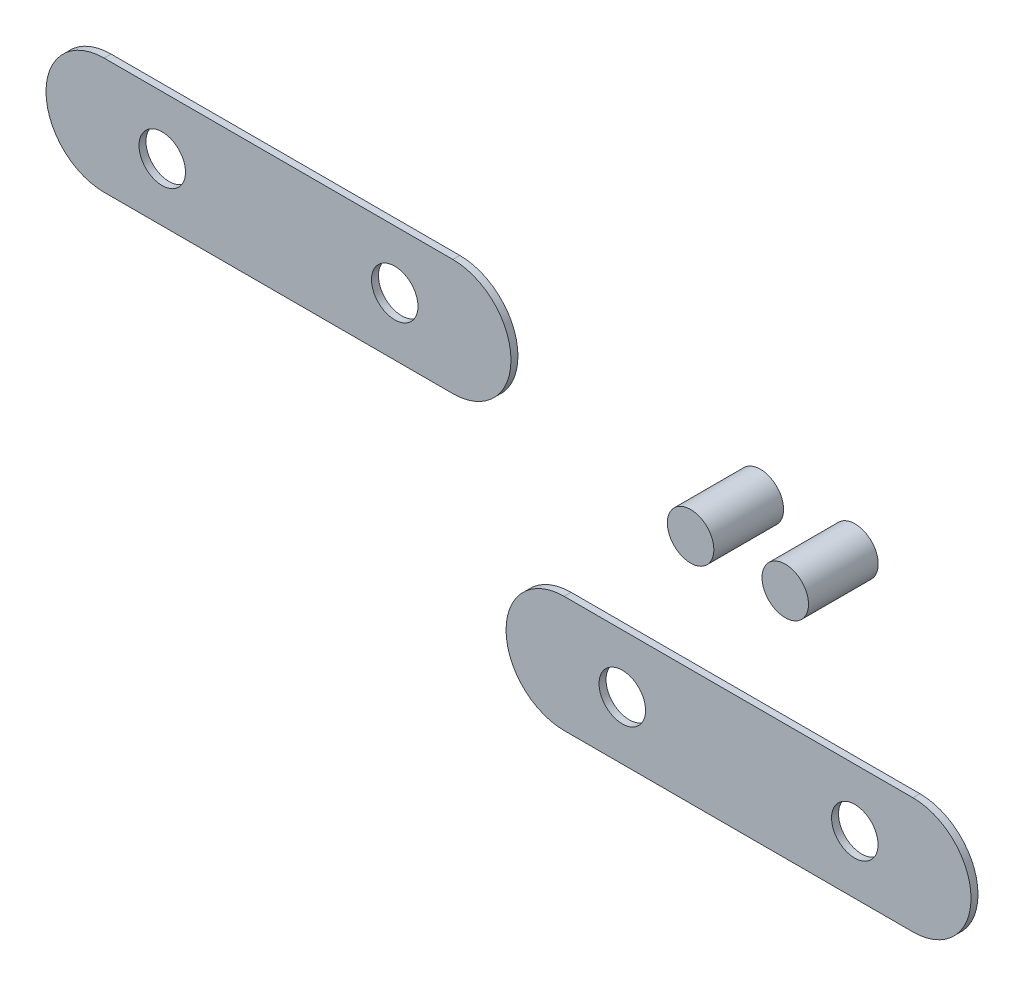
ISO-10303-21;
HEADER;
FILE_DESCRIPTION(('STEP AP214'),'2;1');
FILE_NAME('part.step','',(''),(''),'','','');
FILE_SCHEMA(('AUTOMOTIVE_DESIGN { 1 0 10303 214 1 1 1 1 }'));
ENDSEC;
DATA;
#1=APPLICATION_CONTEXT('core data for automotive mechanical design processes');
#2=APPLICATION_PROTOCOL_DEFINITION('international standard','automotive_design',2000,#1);
#3=PRODUCT_CONTEXT('',#1,'mechanical');
#4=PRODUCT('Part','Part','',(#3));
#5=PRODUCT_RELATED_PRODUCT_CATEGORY('part','',(#4));
#6=PRODUCT_DEFINITION_FORMATION('','',#4);
#7=PRODUCT_DEFINITION_CONTEXT('part definition',#1,'design');
#8=PRODUCT_DEFINITION('design','',#6,#7);
#9=PRODUCT_DEFINITION_SHAPE('','',#8);
#10=(LENGTH_UNIT() NAMED_UNIT(*) SI_UNIT(.MILLI.,.METRE.));
#11=(NAMED_UNIT(*) PLANE_ANGLE_UNIT() SI_UNIT($,.RADIAN.));
#12=(NAMED_UNIT(*) SI_UNIT($,.STERADIAN.) SOLID_ANGLE_UNIT());
#13=UNCERTAINTY_MEASURE_WITH_UNIT(LENGTH_MEASURE(1.E-05),#10,'distance_accuracy_value','');
#14=(GEOMETRIC_REPRESENTATION_CONTEXT(3) GLOBAL_UNCERTAINTY_ASSIGNED_CONTEXT((#13)) GLOBAL_UNIT_ASSIGNED_CONTEXT((#10,
#11,#12)) REPRESENTATION_CONTEXT('',''));
#15=CARTESIAN_POINT('',(0.,0.,0.));
#16=DIRECTION('',(0.,0.,1.));
#17=DIRECTION('',(1.,0.,0.));
#18=AXIS2_PLACEMENT_3D('',#15,#16,#17);
#19=CARTESIAN_POINT('',(-17.3942241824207,0.,0.3));
#20=DIRECTION('',(0.,1.,0.));
#21=DIRECTION('',(0.,0.,1.));
#22=AXIS2_PLACEMENT_3D('',#19,#20,#21);
#23=PLANE('',#22);
#24=DIRECTION('',(1.,0.,0.));
#25=VECTOR('',#24,1.);
#26=CARTESIAN_POINT('',(-17.3942241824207,0.,0.));
#27=LINE('',#26,#25);
#28=CARTESIAN_POINT('',(-15.,0.,0.));
#29=VERTEX_POINT('',#28);
#30=CARTESIAN_POINT('',(0.,0.,0.));
#31=VERTEX_POINT('',#30);
#32=EDGE_CURVE('E122',#29,#31,#27,.T.);
#33=ORIENTED_EDGE('',*,*,#32,.F.);
#34=DIRECTION('',(0.,0.,-1.));
#35=VECTOR('',#34,1.);
#36=CARTESIAN_POINT('',(-15.,0.,0.3));
#37=LINE('',#36,#35);
#38=CARTESIAN_POINT('',(-15.,0.,0.3));
#39=VERTEX_POINT('',#38);
#40=EDGE_CURVE('E12',#39,#29,#37,.T.);
#41=ORIENTED_EDGE('',*,*,#40,.F.);
#42=DIRECTION('',(1.,0.,0.));
#43=VECTOR('',#42,1.);
#44=CARTESIAN_POINT('',(-17.3942241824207,0.,0.3));
#45=LINE('',#44,#43);
#46=CARTESIAN_POINT('',(0.,0.,0.3));
#47=VERTEX_POINT('',#46);
#48=EDGE_CURVE('E104',#39,#47,#45,.T.);
#49=ORIENTED_EDGE('',*,*,#48,.T.);
#50=DIRECTION('',(0.,0.,-1.));
#51=VECTOR('',#50,1.);
#52=CARTESIAN_POINT('',(0.,0.,0.3));
#53=LINE('',#52,#51);
#54=EDGE_CURVE('E85',#47,#31,#53,.T.);
#55=ORIENTED_EDGE('',*,*,#54,.T.);
#56=EDGE_LOOP('',(#33,#41,#49,#55));
#57=FACE_BOUND('',#56,.T.);
#58=ADVANCED_FACE('F46',(#57),#23,.T.);
#59=CARTESIAN_POINT('',(-15.,-2.5,0.3));
#60=DIRECTION('',(0.,0.,-1.));
#61=DIRECTION('',(-1.,0.,0.));
#62=AXIS2_PLACEMENT_3D('',#59,#60,#61);
#63=CYLINDRICAL_SURFACE('',#62,2.5);
#64=CARTESIAN_POINT('',(-15.,-2.5,0.));
#65=DIRECTION('',(0.,0.,1.));
#66=DIRECTION('',(1.,0.,0.));
#67=AXIS2_PLACEMENT_3D('',#64,#65,#66);
#68=CIRCLE('',#67,2.5);
#69=CARTESIAN_POINT('',(-15.,-5.,0.));
#70=VERTEX_POINT('',#69);
#71=EDGE_CURVE('E109',#29,#70,#68,.T.);
#72=ORIENTED_EDGE('',*,*,#71,.T.);
#73=DIRECTION('',(0.,0.,-1.));
#74=VECTOR('',#73,1.);
#75=CARTESIAN_POINT('',(-15.,-5.,0.3));
#76=LINE('',#75,#74);
#77=CARTESIAN_POINT('',(-15.,-5.,0.3));
#78=VERTEX_POINT('',#77);
#79=EDGE_CURVE('E55',#78,#70,#76,.T.);
#80=ORIENTED_EDGE('',*,*,#79,.F.);
#81=CARTESIAN_POINT('',(-15.,-2.5,0.3));
#82=DIRECTION('',(0.,0.,1.));
#83=DIRECTION('',(1.,0.,0.));
#84=AXIS2_PLACEMENT_3D('',#81,#82,#83);
#85=CIRCLE('',#84,2.5);
#86=EDGE_CURVE('E100',#39,#78,#85,.T.);
#87=ORIENTED_EDGE('',*,*,#86,.F.);
#88=ORIENTED_EDGE('',*,*,#40,.T.);
#89=EDGE_LOOP('',(#72,#80,#87,#88));
#90=FACE_BOUND('',#89,.T.);
#91=ADVANCED_FACE('F107',(#90),#63,.T.);
#92=CARTESIAN_POINT('',(-17.3942241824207,-5.,0.3));
#93=DIRECTION('',(0.,1.,0.));
#94=DIRECTION('',(0.,0.,1.));
#95=AXIS2_PLACEMENT_3D('',#92,#93,#94);
#96=PLANE('',#95);
#97=DIRECTION('',(1.,0.,0.));
#98=VECTOR('',#97,1.);
#99=CARTESIAN_POINT('',(-17.3942241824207,-5.,0.));
#100=LINE('',#99,#98);
#101=CARTESIAN_POINT('',(0.,-5.,0.));
#102=VERTEX_POINT('',#101);
#103=EDGE_CURVE('E119',#70,#102,#100,.T.);
#104=ORIENTED_EDGE('',*,*,#103,.T.);
#105=DIRECTION('',(0.,0.,-1.));
#106=VECTOR('',#105,1.);
#107=CARTESIAN_POINT('',(0.,-5.,0.3));
#108=LINE('',#107,#106);
#109=CARTESIAN_POINT('',(0.,-5.,0.3));
#110=VERTEX_POINT('',#109);
#111=EDGE_CURVE('E99',#110,#102,#108,.T.);
#112=ORIENTED_EDGE('',*,*,#111,.F.);
#113=DIRECTION('',(1.,0.,0.));
#114=VECTOR('',#113,1.);
#115=CARTESIAN_POINT('',(-17.3942241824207,-5.,0.3));
#116=LINE('',#115,#114);
#117=EDGE_CURVE('E93',#78,#110,#116,.T.);
#118=ORIENTED_EDGE('',*,*,#117,.F.);
#119=ORIENTED_EDGE('',*,*,#79,.T.);
#120=EDGE_LOOP('',(#104,#112,#118,#119));
#121=FACE_BOUND('',#120,.T.);
#122=ADVANCED_FACE('F96',(#121),#96,.F.);
#123=CARTESIAN_POINT('',(0.,-2.5,0.3));
#124=DIRECTION('',(0.,0.,-1.));
#125=DIRECTION('',(-1.,0.,0.));
#126=AXIS2_PLACEMENT_3D('',#123,#124,#125);
#127=CYLINDRICAL_SURFACE('',#126,2.5);
#128=CARTESIAN_POINT('',(0.,-2.5,0.));
#129=DIRECTION('',(0.,0.,1.));
#130=DIRECTION('',(1.,0.,0.));
#131=AXIS2_PLACEMENT_3D('',#128,#129,#130);
#132=CIRCLE('',#131,2.5);
#133=EDGE_CURVE('E78',#102,#31,#132,.T.);
#134=ORIENTED_EDGE('',*,*,#133,.T.);
#135=ORIENTED_EDGE('',*,*,#54,.F.);
#136=CARTESIAN_POINT('',(0.,-2.5,0.3));
#137=DIRECTION('',(0.,0.,1.));
#138=DIRECTION('',(1.,0.,0.));
#139=AXIS2_PLACEMENT_3D('',#136,#137,#138);
#140=CIRCLE('',#139,2.5);
#141=EDGE_CURVE('E63',#110,#47,#140,.T.);
#142=ORIENTED_EDGE('',*,*,#141,.F.);
#143=ORIENTED_EDGE('',*,*,#111,.T.);
#144=EDGE_LOOP('',(#134,#135,#142,#143));
#145=FACE_BOUND('',#144,.T.);
#146=ADVANCED_FACE('F156',(#145),#127,.T.);
#147=CARTESIAN_POINT('',(-2.5,-2.5,0.3));
#148=DIRECTION('',(0.,0.,-1.));
#149=DIRECTION('',(-1.,0.,0.));
#150=AXIS2_PLACEMENT_3D('',#147,#148,#149);
#151=CYLINDRICAL_SURFACE('',#150,1.);
#152=CARTESIAN_POINT('',(-2.5,-2.5,0.3));
#153=DIRECTION('',(0.,0.,1.));
#154=DIRECTION('',(1.,0.,0.));
#155=AXIS2_PLACEMENT_3D('',#152,#153,#154);
#156=CIRCLE('',#155,1.);
#157=CARTESIAN_POINT('',(-1.5,-2.5,0.3));
#158=VERTEX_POINT('',#157);
#159=EDGE_CURVE('E117',#158,#158,#156,.T.);
#160=ORIENTED_EDGE('',*,*,#159,.T.);
#161=EDGE_LOOP('',(#160));
#162=FACE_BOUND('',#161,.T.);
#163=CARTESIAN_POINT('',(-2.5,-2.5,0.));
#164=DIRECTION('',(0.,0.,1.));
#165=DIRECTION('',(1.,0.,0.));
#166=AXIS2_PLACEMENT_3D('',#163,#164,#165);
#167=CIRCLE('',#166,1.);
#168=CARTESIAN_POINT('',(-1.5,-2.5,0.));
#169=VERTEX_POINT('',#168);
#170=EDGE_CURVE('E124',#169,#169,#167,.T.);
#171=ORIENTED_EDGE('',*,*,#170,.F.);
#172=EDGE_LOOP('',(#171));
#173=FACE_BOUND('',#172,.T.);
#174=ADVANCED_FACE('F48',(#162,#173),#151,.F.);
#175=CARTESIAN_POINT('',(-12.5,-2.5,0.3));
#176=DIRECTION('',(0.,0.,-1.));
#177=DIRECTION('',(-1.,0.,0.));
#178=AXIS2_PLACEMENT_3D('',#175,#176,#177);
#179=CYLINDRICAL_SURFACE('',#178,1.);
#180=CARTESIAN_POINT('',(-12.5,-2.5,0.3));
#181=DIRECTION('',(0.,0.,1.));
#182=DIRECTION('',(1.,0.,0.));
#183=AXIS2_PLACEMENT_3D('',#180,#181,#182);
#184=CIRCLE('',#183,1.);
#185=CARTESIAN_POINT('',(-11.5,-2.5,0.3));
#186=VERTEX_POINT('',#185);
#187=EDGE_CURVE('E113',#186,#186,#184,.T.);
#188=ORIENTED_EDGE('',*,*,#187,.T.);
#189=EDGE_LOOP('',(#188));
#190=FACE_BOUND('',#189,.T.);
#191=CARTESIAN_POINT('',(-12.5,-2.5,0.));
#192=DIRECTION('',(0.,0.,1.));
#193=DIRECTION('',(1.,0.,0.));
#194=AXIS2_PLACEMENT_3D('',#191,#192,#193);
#195=CIRCLE('',#194,1.);
#196=CARTESIAN_POINT('',(-11.5,-2.5,0.));
#197=VERTEX_POINT('',#196);
#198=EDGE_CURVE('E114',#197,#197,#195,.T.);
#199=ORIENTED_EDGE('',*,*,#198,.F.);
#200=EDGE_LOOP('',(#199));
#201=FACE_BOUND('',#200,.T.);
#202=ADVANCED_FACE('F138',(#190,#201),#179,.F.);
#203=CARTESIAN_POINT('',(-17.3942241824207,-30.6805718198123,0.3));
#204=DIRECTION('',(0.,0.,1.));
#205=DIRECTION('',(1.,0.,0.));
#206=AXIS2_PLACEMENT_3D('',#203,#204,#205);
#207=PLANE('',#206);
#208=ORIENTED_EDGE('',*,*,#159,.F.);
#209=EDGE_LOOP('',(#208));
#210=FACE_BOUND('',#209,.T.);
#211=ORIENTED_EDGE('',*,*,#48,.F.);
#212=ORIENTED_EDGE('',*,*,#86,.T.);
#213=ORIENTED_EDGE('',*,*,#117,.T.);
#214=ORIENTED_EDGE('',*,*,#141,.T.);
#215=EDGE_LOOP('',(#211,#212,#213,#214));
#216=FACE_BOUND('',#215,.T.);
#217=ORIENTED_EDGE('',*,*,#187,.F.);
#218=EDGE_LOOP('',(#217));
#219=FACE_BOUND('',#218,.T.);
#220=ADVANCED_FACE('F102',(#210,#216,#219),#207,.T.);
#221=CARTESIAN_POINT('',(-17.3942241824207,-30.6805718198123,0.));
#222=DIRECTION('',(0.,0.,1.));
#223=DIRECTION('',(1.,0.,0.));
#224=AXIS2_PLACEMENT_3D('',#221,#222,#223);
#225=PLANE('',#224);
#226=ORIENTED_EDGE('',*,*,#170,.T.);
#227=EDGE_LOOP('',(#226));
#228=FACE_BOUND('',#227,.T.);
#229=ORIENTED_EDGE('',*,*,#32,.T.);
#230=ORIENTED_EDGE('',*,*,#133,.F.);
#231=ORIENTED_EDGE('',*,*,#103,.F.);
#232=ORIENTED_EDGE('',*,*,#71,.F.);
#233=EDGE_LOOP('',(#229,#230,#231,#232));
#234=FACE_BOUND('',#233,.T.);
#235=ORIENTED_EDGE('',*,*,#198,.T.);
#236=EDGE_LOOP('',(#235));
#237=FACE_BOUND('',#236,.T.);
#238=ADVANCED_FACE('F137',(#228,#234,#237),#225,.F.);
#239=CLOSED_SHELL('',(#58,#91,#122,#146,#174,#202,#220,#238));
#240=MANIFOLD_SOLID_BREP('B2',#239);
#241=CARTESIAN_POINT('',(-17.3942241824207,10.1569098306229,0.3));
#242=DIRECTION('',(0.,1.,0.));
#243=DIRECTION('',(0.,0.,1.));
#244=AXIS2_PLACEMENT_3D('',#241,#242,#243);
#245=PLANE('',#244);
#246=DIRECTION('',(1.,0.,0.));
#247=VECTOR('',#246,1.);
#248=CARTESIAN_POINT('',(-17.3942241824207,10.1569098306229,0.));
#249=LINE('',#248,#247);
#250=CARTESIAN_POINT('',(-34.7884483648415,10.1569098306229,0.));
#251=VERTEX_POINT('',#250);
#252=CARTESIAN_POINT('',(-19.7884483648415,10.1569098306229,0.));
#253=VERTEX_POINT('',#252);
#254=EDGE_CURVE('E320',#251,#253,#249,.T.);
#255=ORIENTED_EDGE('',*,*,#254,.F.);
#256=DIRECTION('',(0.,0.,-1.));
#257=VECTOR('',#256,1.);
#258=CARTESIAN_POINT('',(-34.7884483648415,10.1569098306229,0.3));
#259=LINE('',#258,#257);
#260=CARTESIAN_POINT('',(-34.7884483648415,10.1569098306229,0.3));
#261=VERTEX_POINT('',#260);
#262=EDGE_CURVE('E44',#261,#251,#259,.T.);
#263=ORIENTED_EDGE('',*,*,#262,.F.);
#264=DIRECTION('',(1.,0.,0.));
#265=VECTOR('',#264,1.);
#266=CARTESIAN_POINT('',(-17.3942241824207,10.1569098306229,0.3));
#267=LINE('',#266,#265);
#268=CARTESIAN_POINT('',(-19.7884483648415,10.1569098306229,0.3));
#269=VERTEX_POINT('',#268);
#270=EDGE_CURVE('E302',#261,#269,#267,.T.);
#271=ORIENTED_EDGE('',*,*,#270,.T.);
#272=DIRECTION('',(0.,0.,-1.));
#273=VECTOR('',#272,1.);
#274=CARTESIAN_POINT('',(-19.7884483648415,10.1569098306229,0.3));
#275=LINE('',#274,#273);
#276=EDGE_CURVE('E283',#269,#253,#275,.T.);
#277=ORIENTED_EDGE('',*,*,#276,.T.);
#278=EDGE_LOOP('',(#255,#263,#271,#277));
#279=FACE_BOUND('',#278,.T.);
#280=ADVANCED_FACE('F244',(#279),#245,.T.);
#281=CARTESIAN_POINT('',(-34.7884483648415,7.65690983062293,0.3));
#282=DIRECTION('',(0.,0.,-1.));
#283=DIRECTION('',(-1.,0.,0.));
#284=AXIS2_PLACEMENT_3D('',#281,#282,#283);
#285=CYLINDRICAL_SURFACE('',#284,2.5);
#286=CARTESIAN_POINT('',(-34.7884483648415,7.65690983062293,0.));
#287=DIRECTION('',(0.,0.,1.));
#288=DIRECTION('',(1.,0.,0.));
#289=AXIS2_PLACEMENT_3D('',#286,#287,#288);
#290=CIRCLE('',#289,2.5);
#291=CARTESIAN_POINT('',(-34.7884483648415,5.15690983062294,0.));
#292=VERTEX_POINT('',#291);
#293=EDGE_CURVE('E307',#251,#292,#290,.T.);
#294=ORIENTED_EDGE('',*,*,#293,.T.);
#295=DIRECTION('',(0.,0.,-1.));
#296=VECTOR('',#295,1.);
#297=CARTESIAN_POINT('',(-34.7884483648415,5.15690983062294,0.3));
#298=LINE('',#297,#296);
#299=CARTESIAN_POINT('',(-34.7884483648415,5.15690983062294,0.3));
#300=VERTEX_POINT('',#299);
#301=EDGE_CURVE('E253',#300,#292,#298,.T.);
#302=ORIENTED_EDGE('',*,*,#301,.F.);
#303=CARTESIAN_POINT('',(-34.7884483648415,7.65690983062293,0.3));
#304=DIRECTION('',(0.,0.,1.));
#305=DIRECTION('',(1.,0.,0.));
#306=AXIS2_PLACEMENT_3D('',#303,#304,#305);
#307=CIRCLE('',#306,2.5);
#308=EDGE_CURVE('E298',#261,#300,#307,.T.);
#309=ORIENTED_EDGE('',*,*,#308,.F.);
#310=ORIENTED_EDGE('',*,*,#262,.T.);
#311=EDGE_LOOP('',(#294,#302,#309,#310));
#312=FACE_BOUND('',#311,.T.);
#313=ADVANCED_FACE('F305',(#312),#285,.T.);
#314=CARTESIAN_POINT('',(-17.3942241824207,5.15690983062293,0.3));
#315=DIRECTION('',(0.,1.,0.));
#316=DIRECTION('',(0.,0.,1.));
#317=AXIS2_PLACEMENT_3D('',#314,#315,#316);
#318=PLANE('',#317);
#319=DIRECTION('',(1.,0.,0.));
#320=VECTOR('',#319,1.);
#321=CARTESIAN_POINT('',(-17.3942241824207,5.15690983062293,0.));
#322=LINE('',#321,#320);
#323=CARTESIAN_POINT('',(-19.7884483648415,5.15690983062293,0.));
#324=VERTEX_POINT('',#323);
#325=EDGE_CURVE('E317',#292,#324,#322,.T.);
#326=ORIENTED_EDGE('',*,*,#325,.T.);
#327=DIRECTION('',(0.,0.,-1.));
#328=VECTOR('',#327,1.);
#329=CARTESIAN_POINT('',(-19.7884483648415,5.15690983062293,0.3));
#330=LINE('',#329,#328);
#331=CARTESIAN_POINT('',(-19.7884483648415,5.15690983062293,0.3));
#332=VERTEX_POINT('',#331);
#333=EDGE_CURVE('E297',#332,#324,#330,.T.);
#334=ORIENTED_EDGE('',*,*,#333,.F.);
#335=DIRECTION('',(1.,0.,0.));
#336=VECTOR('',#335,1.);
#337=CARTESIAN_POINT('',(-17.3942241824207,5.15690983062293,0.3));
#338=LINE('',#337,#336);
#339=EDGE_CURVE('E291',#300,#332,#338,.T.);
#340=ORIENTED_EDGE('',*,*,#339,.F.);
#341=ORIENTED_EDGE('',*,*,#301,.T.);
#342=EDGE_LOOP('',(#326,#334,#340,#341));
#343=FACE_BOUND('',#342,.T.);
#344=ADVANCED_FACE('F294',(#343),#318,.F.);
#345=CARTESIAN_POINT('',(-19.7884483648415,7.65690983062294,0.3));
#346=DIRECTION('',(0.,0.,-1.));
#347=DIRECTION('',(-1.,0.,0.));
#348=AXIS2_PLACEMENT_3D('',#345,#346,#347);
#349=CYLINDRICAL_SURFACE('',#348,2.5);
#350=CARTESIAN_POINT('',(-19.7884483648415,7.65690983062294,0.));
#351=DIRECTION('',(0.,0.,1.));
#352=DIRECTION('',(1.,0.,0.));
#353=AXIS2_PLACEMENT_3D('',#350,#351,#352);
#354=CIRCLE('',#353,2.5);
#355=EDGE_CURVE('E276',#324,#253,#354,.T.);
#356=ORIENTED_EDGE('',*,*,#355,.T.);
#357=ORIENTED_EDGE('',*,*,#276,.F.);
#358=CARTESIAN_POINT('',(-19.7884483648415,7.65690983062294,0.3));
#359=DIRECTION('',(0.,0.,1.));
#360=DIRECTION('',(1.,0.,0.));
#361=AXIS2_PLACEMENT_3D('',#358,#359,#360);
#362=CIRCLE('',#361,2.5);
#363=EDGE_CURVE('E261',#332,#269,#362,.T.);
#364=ORIENTED_EDGE('',*,*,#363,.F.);
#365=ORIENTED_EDGE('',*,*,#333,.T.);
#366=EDGE_LOOP('',(#356,#357,#364,#365));
#367=FACE_BOUND('',#366,.T.);
#368=ADVANCED_FACE('F354',(#367),#349,.T.);
#369=CARTESIAN_POINT('',(-22.2884483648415,7.65690983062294,0.3));
#370=DIRECTION('',(0.,0.,-1.));
#371=DIRECTION('',(-1.,0.,0.));
#372=AXIS2_PLACEMENT_3D('',#369,#370,#371);
#373=CYLINDRICAL_SURFACE('',#372,1.);
#374=CARTESIAN_POINT('',(-22.2884483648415,7.65690983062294,0.3));
#375=DIRECTION('',(0.,0.,1.));
#376=DIRECTION('',(1.,0.,0.));
#377=AXIS2_PLACEMENT_3D('',#374,#375,#376);
#378=CIRCLE('',#377,1.);
#379=CARTESIAN_POINT('',(-21.2884483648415,7.65690983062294,0.3));
#380=VERTEX_POINT('',#379);
#381=EDGE_CURVE('E315',#380,#380,#378,.T.);
#382=ORIENTED_EDGE('',*,*,#381,.T.);
#383=EDGE_LOOP('',(#382));
#384=FACE_BOUND('',#383,.T.);
#385=CARTESIAN_POINT('',(-22.2884483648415,7.65690983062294,0.));
#386=DIRECTION('',(0.,0.,1.));
#387=DIRECTION('',(1.,0.,0.));
#388=AXIS2_PLACEMENT_3D('',#385,#386,#387);
#389=CIRCLE('',#388,1.);
#390=CARTESIAN_POINT('',(-21.2884483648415,7.65690983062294,0.));
#391=VERTEX_POINT('',#390);
#392=EDGE_CURVE('E322',#391,#391,#389,.T.);
#393=ORIENTED_EDGE('',*,*,#392,.F.);
#394=EDGE_LOOP('',(#393));
#395=FACE_BOUND('',#394,.T.);
#396=ADVANCED_FACE('F246',(#384,#395),#373,.F.);
#397=CARTESIAN_POINT('',(-32.2884483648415,7.65690983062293,0.3));
#398=DIRECTION('',(0.,0.,-1.));
#399=DIRECTION('',(-1.,0.,0.));
#400=AXIS2_PLACEMENT_3D('',#397,#398,#399);
#401=CYLINDRICAL_SURFACE('',#400,0.999999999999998);
#402=CARTESIAN_POINT('',(-32.2884483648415,7.65690983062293,0.3));
#403=DIRECTION('',(0.,0.,1.));
#404=DIRECTION('',(1.,0.,0.));
#405=AXIS2_PLACEMENT_3D('',#402,#403,#404);
#406=CIRCLE('',#405,0.999999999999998);
#407=CARTESIAN_POINT('',(-31.2884483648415,7.65690983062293,0.3));
#408=VERTEX_POINT('',#407);
#409=EDGE_CURVE('E311',#408,#408,#406,.T.);
#410=ORIENTED_EDGE('',*,*,#409,.T.);
#411=EDGE_LOOP('',(#410));
#412=FACE_BOUND('',#411,.T.);
#413=CARTESIAN_POINT('',(-32.2884483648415,7.65690983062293,0.));
#414=DIRECTION('',(0.,0.,1.));
#415=DIRECTION('',(1.,0.,0.));
#416=AXIS2_PLACEMENT_3D('',#413,#414,#415);
#417=CIRCLE('',#416,0.999999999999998);
#418=CARTESIAN_POINT('',(-31.2884483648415,7.65690983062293,0.));
#419=VERTEX_POINT('',#418);
#420=EDGE_CURVE('E312',#419,#419,#417,.T.);
#421=ORIENTED_EDGE('',*,*,#420,.F.);
#422=EDGE_LOOP('',(#421));
#423=FACE_BOUND('',#422,.T.);
#424=ADVANCED_FACE('F336',(#412,#423),#401,.F.);
#425=CARTESIAN_POINT('',(-17.3942241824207,-30.6805718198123,0.3));
#426=DIRECTION('',(0.,0.,1.));
#427=DIRECTION('',(1.,0.,0.));
#428=AXIS2_PLACEMENT_3D('',#425,#426,#427);
#429=PLANE('',#428);
#430=ORIENTED_EDGE('',*,*,#381,.F.);
#431=EDGE_LOOP('',(#430));
#432=FACE_BOUND('',#431,.T.);
#433=ORIENTED_EDGE('',*,*,#270,.F.);
#434=ORIENTED_EDGE('',*,*,#308,.T.);
#435=ORIENTED_EDGE('',*,*,#339,.T.);
#436=ORIENTED_EDGE('',*,*,#363,.T.);
#437=EDGE_LOOP('',(#433,#434,#435,#436));
#438=FACE_BOUND('',#437,.T.);
#439=ORIENTED_EDGE('',*,*,#409,.F.);
#440=EDGE_LOOP('',(#439));
#441=FACE_BOUND('',#440,.T.);
#442=ADVANCED_FACE('F300',(#432,#438,#441),#429,.T.);
#443=CARTESIAN_POINT('',(-17.3942241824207,-30.6805718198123,0.));
#444=DIRECTION('',(0.,0.,1.));
#445=DIRECTION('',(1.,0.,0.));
#446=AXIS2_PLACEMENT_3D('',#443,#444,#445);
#447=PLANE('',#446);
#448=ORIENTED_EDGE('',*,*,#392,.T.);
#449=EDGE_LOOP('',(#448));
#450=FACE_BOUND('',#449,.T.);
#451=ORIENTED_EDGE('',*,*,#254,.T.);
#452=ORIENTED_EDGE('',*,*,#355,.F.);
#453=ORIENTED_EDGE('',*,*,#325,.F.);
#454=ORIENTED_EDGE('',*,*,#293,.F.);
#455=EDGE_LOOP('',(#451,#452,#453,#454));
#456=FACE_BOUND('',#455,.T.);
#457=ORIENTED_EDGE('',*,*,#420,.T.);
#458=EDGE_LOOP('',(#457));
#459=FACE_BOUND('',#458,.T.);
#460=ADVANCED_FACE('F335',(#450,#456,#459),#447,.F.);
#461=CLOSED_SHELL('',(#280,#313,#344,#368,#396,#424,#442,#460));
#462=MANIFOLD_SOLID_BREP('B6',#461);
#463=CARTESIAN_POINT('',(-2.79077536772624,7.65690983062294,3.));
#464=DIRECTION('',(0.,0.,-1.));
#465=DIRECTION('',(-1.,0.,0.));
#466=AXIS2_PLACEMENT_3D('',#463,#464,#465);
#467=CYLINDRICAL_SURFACE('',#466,1.);
#468=CARTESIAN_POINT('',(-2.79077536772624,7.65690983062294,3.));
#469=DIRECTION('',(0.,0.,1.));
#470=DIRECTION('',(1.,0.,0.));
#471=AXIS2_PLACEMENT_3D('',#468,#469,#470);
#472=CIRCLE('',#471,1.);
#473=CARTESIAN_POINT('',(-1.79077536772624,7.65690983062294,3.));
#474=VERTEX_POINT('',#473);
#475=EDGE_CURVE('E243',#474,#474,#472,.T.);
#476=ORIENTED_EDGE('',*,*,#475,.F.);
#477=EDGE_LOOP('',(#476));
#478=FACE_BOUND('',#477,.T.);
#479=CARTESIAN_POINT('',(-2.79077536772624,7.65690983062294,0.));
#480=DIRECTION('',(0.,0.,1.));
#481=DIRECTION('',(1.,0.,0.));
#482=AXIS2_PLACEMENT_3D('',#479,#480,#481);
#483=CIRCLE('',#482,1.);
#484=CARTESIAN_POINT('',(-1.79077536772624,7.65690983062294,0.));
#485=VERTEX_POINT('',#484);
#486=EDGE_CURVE('E444',#485,#485,#483,.T.);
#487=ORIENTED_EDGE('',*,*,#486,.T.);
#488=EDGE_LOOP('',(#487));
#489=FACE_BOUND('',#488,.T.);
#490=ADVANCED_FACE('F441',(#478,#489),#467,.T.);
#491=CARTESIAN_POINT('',(-17.3942241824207,-30.6805718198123,3.));
#492=DIRECTION('',(0.,0.,1.));
#493=DIRECTION('',(1.,0.,0.));
#494=AXIS2_PLACEMENT_3D('',#491,#492,#493);
#495=PLANE('',#494);
#496=ORIENTED_EDGE('',*,*,#475,.T.);
#497=EDGE_LOOP('',(#496));
#498=FACE_BOUND('',#497,.T.);
#499=ADVANCED_FACE('F456',(#498),#495,.T.);
#500=CARTESIAN_POINT('',(-17.3942241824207,-30.6805718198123,0.));
#501=DIRECTION('',(0.,0.,1.));
#502=DIRECTION('',(1.,0.,0.));
#503=AXIS2_PLACEMENT_3D('',#500,#501,#502);
#504=PLANE('',#503);
#505=ORIENTED_EDGE('',*,*,#486,.F.);
#506=EDGE_LOOP('',(#505));
#507=FACE_BOUND('',#506,.T.);
#508=ADVANCED_FACE('F454',(#507),#504,.F.);
#509=CLOSED_SHELL('',(#490,#499,#508));
#510=MANIFOLD_SOLID_BREP('B38',#509);
#511=CARTESIAN_POINT('',(-6.86228259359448,7.65690983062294,3.));
#512=DIRECTION('',(0.,0.,-1.));
#513=DIRECTION('',(-1.,0.,0.));
#514=AXIS2_PLACEMENT_3D('',#511,#512,#513);
#515=CYLINDRICAL_SURFACE('',#514,1.);
#516=CARTESIAN_POINT('',(-6.86228259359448,7.65690983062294,3.));
#517=DIRECTION('',(0.,0.,1.));
#518=DIRECTION('',(1.,0.,0.));
#519=AXIS2_PLACEMENT_3D('',#516,#517,#518);
#520=CIRCLE('',#519,1.);
#521=CARTESIAN_POINT('',(-5.86228259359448,7.65690983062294,3.));
#522=VERTEX_POINT('',#521);
#523=EDGE_CURVE('E440',#522,#522,#520,.T.);
#524=ORIENTED_EDGE('',*,*,#523,.F.);
#525=EDGE_LOOP('',(#524));
#526=FACE_BOUND('',#525,.T.);
#527=CARTESIAN_POINT('',(-6.86228259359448,7.65690983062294,0.));
#528=DIRECTION('',(0.,0.,1.));
#529=DIRECTION('',(1.,0.,0.));
#530=AXIS2_PLACEMENT_3D('',#527,#528,#529);
#531=CIRCLE('',#530,1.);
#532=CARTESIAN_POINT('',(-5.86228259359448,7.65690983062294,0.));
#533=VERTEX_POINT('',#532);
#534=EDGE_CURVE('E485',#533,#533,#531,.T.);
#535=ORIENTED_EDGE('',*,*,#534,.T.);
#536=EDGE_LOOP('',(#535));
#537=FACE_BOUND('',#536,.T.);
#538=ADVANCED_FACE('F482',(#526,#537),#515,.T.);
#539=CARTESIAN_POINT('',(-17.3942241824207,-30.6805718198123,3.));
#540=DIRECTION('',(0.,0.,1.));
#541=DIRECTION('',(1.,0.,0.));
#542=AXIS2_PLACEMENT_3D('',#539,#540,#541);
#543=PLANE('',#542);
#544=ORIENTED_EDGE('',*,*,#523,.T.);
#545=EDGE_LOOP('',(#544));
#546=FACE_BOUND('',#545,.T.);
#547=ADVANCED_FACE('F497',(#546),#543,.T.);
#548=CARTESIAN_POINT('',(-17.3942241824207,-30.6805718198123,0.));
#549=DIRECTION('',(0.,0.,1.));
#550=DIRECTION('',(1.,0.,0.));
#551=AXIS2_PLACEMENT_3D('',#548,#549,#550);
#552=PLANE('',#551);
#553=ORIENTED_EDGE('',*,*,#534,.F.);
#554=EDGE_LOOP('',(#553));
#555=FACE_BOUND('',#554,.T.);
#556=ADVANCED_FACE('F495',(#555),#552,.F.);
#557=CLOSED_SHELL('',(#538,#547,#556));
#558=MANIFOLD_SOLID_BREP('B238',#557);
#559=ADVANCED_BREP_SHAPE_REPRESENTATION('',(#18,#240,#462,#510,#558),#14);
#560=SHAPE_DEFINITION_REPRESENTATION(#9,#559);
ENDSEC;
END-ISO-10303-21;
